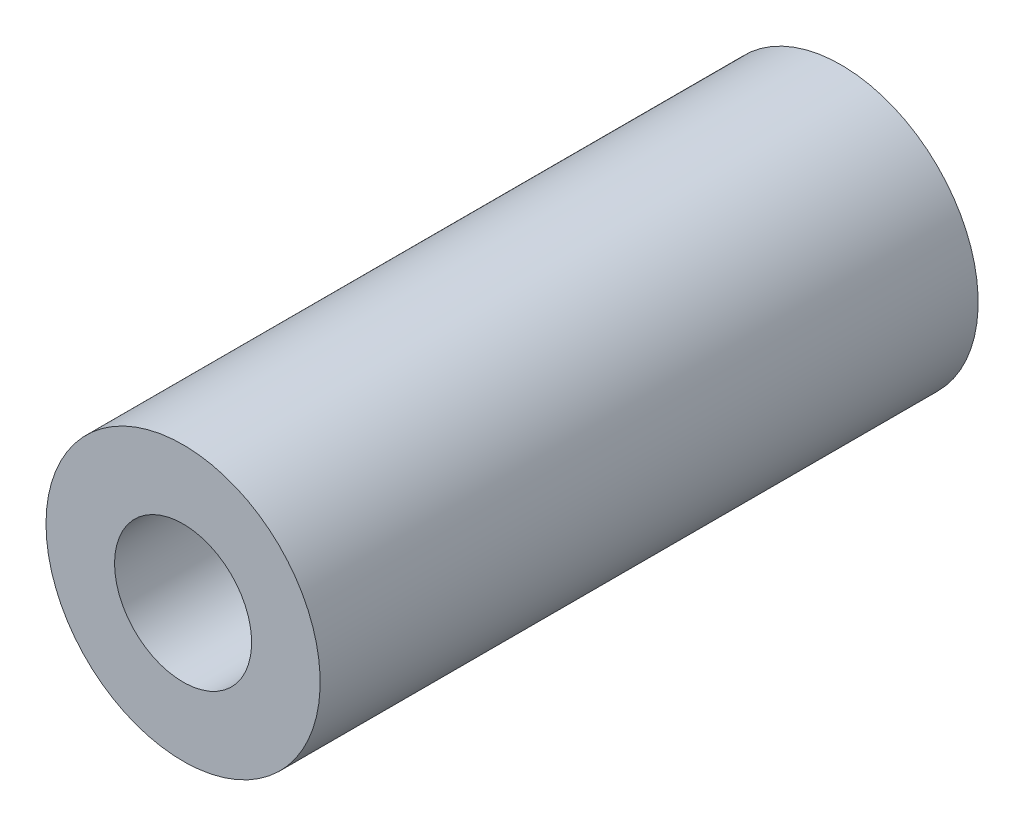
from build123d import *

# Parameters (mm, degrees)
SKETCH1_R           = 6.35
SKETCH1_R_2         = 3.175
BOSS_EXTRUDE1_DEPTH = 30.48


with BuildPart() as part:
    # Sketch1 → Boss-Extrude1 (new body)
    with BuildSketch(Plane.XY):
        with Locations(Location((0, 0, 0), (0, 0, 180))):
            Circle(SKETCH1_R)
        with Locations(Location((0, 0, 0), (0, 0, 180))):
            Circle(SKETCH1_R_2, mode=Mode.SUBTRACT)
    extrude(amount=BOSS_EXTRUDE1_DEPTH)


solid = part.part
